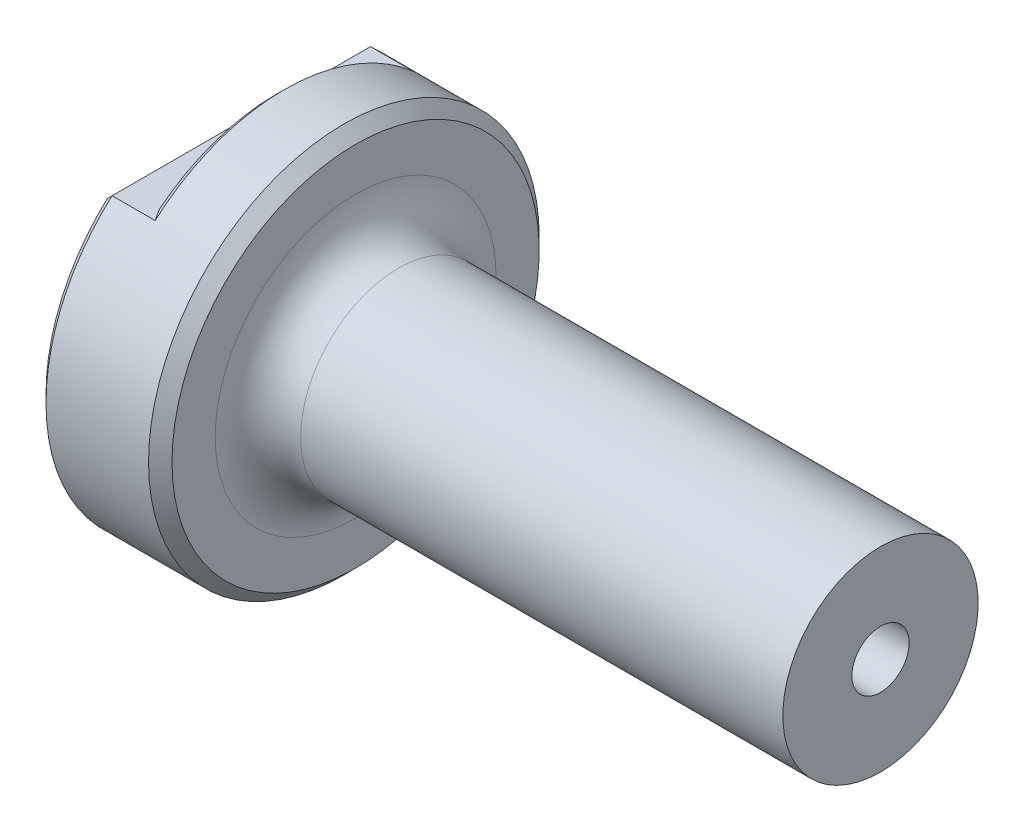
from build123d import *

# Parameters (mm, degrees)
SKETCH1_R           = 25.4
BOSS_EXTRUDE1_DEPTH = 42.06875
SKETCH3_W           = 50.8
SKETCH3_H           = 6.35
CUT_EXTRUDE1_DEPTH  = 5.588
SKETCH5_W           = 68.2625
SKETCH5_H           = 12.7
FILLET1_R           = 5.55625
CHAMFER1_SIZE       = 1.524
CHAMFER2_SIZE       = 1.016


with BuildPart() as part:
    # Sketch1 → Boss-Extrude1 (new, symmetric)
    with BuildSketch(Plane(origin=(0, 0, 0), x_dir=(0, 0, -1), z_dir=(1, 0, 0))):
        Circle(SKETCH1_R)
    extrude(amount=BOSS_EXTRUDE1_DEPTH, both=True)

    # Sketch3 → Cut-Extrude1 (cut)
    with BuildSketch(Plane.ZY.offset(42.06875)):
        with Locations((0, 22.225)):
            Rectangle(SKETCH3_W, SKETCH3_H)
    extrude(amount=-CUT_EXTRUDE1_DEPTH, mode=Mode.SUBTRACT)

    # Sketch5 → Cut-Revolve1 (revolve, cut)
    with BuildSketch(Plane.XY, mode=Mode.PRIVATE) as cut_revolve1_sk:
        with Locations((7.9375, -19.05)):
            Rectangle(SKETCH5_W, SKETCH5_H)
    revolve(cut_revolve1_sk.sketch.rotate(Axis((42.06875, 0, 0), (-1, 0, 0)), 138.590377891), axis=Axis((42.06875, 0, 0), (-1, 0, 0)), mode=Mode.SUBTRACT)

    # Sketch6 → Cut-Revolve2 (revolve, cut)
    with BuildSketch(Plane.XY):
        with BuildLine():
            Line((-37.44595, 0), (-42.06875, 0))
            Line((-42.06875, 0), (-42.06875, 12.440192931))
            ThreePointArc((-42.06875, 12.440192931), (-38.639009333, 6.635674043), (-37.44595, 0))
        make_face()
    revolve(axis=Axis((42.06875, 0, 0), (-1, 0, 0)), mode=Mode.SUBTRACT)

    # Sketch7 → Cut-Revolve3 (revolve, cut)
    with BuildSketch(Plane.XY):
        Polygon((-37.549584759, 1.984375), (42.06875, 3.721653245), (42.06875, 0), (-37.549584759, 0), align=None)
    revolve(axis=Axis((42.06875, 0, 0), (-1, 0, 0)), mode=Mode.SUBTRACT)

    # Fillet1
    fillet1_edges = [part.edges().sort_by_distance(p)[0] for p in [
        (-26.19375, -9.525, -8.400260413),
    ]]
    fillet(fillet1_edges, radius=FILLET1_R)

    # Chamfer1
    chamfer1_edges = [part.edges().sort_by_distance(p)[0] for p in [
        (-26.19375, 0, 25.4),
    ]]
    chamfer(chamfer1_edges, length=CHAMFER1_SIZE)

    # Chamfer2
    chamfer2_edges = [part.edges().sort_by_distance(p)[0] for p in [
        (-42.06875, -23.150520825, 10.450520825),
        (-42.06875, 19.05, 0),
        (-36.48075, 25.4, 0),
    ]]
    chamfer(chamfer2_edges, length=CHAMFER2_SIZE)


solid = part.part
